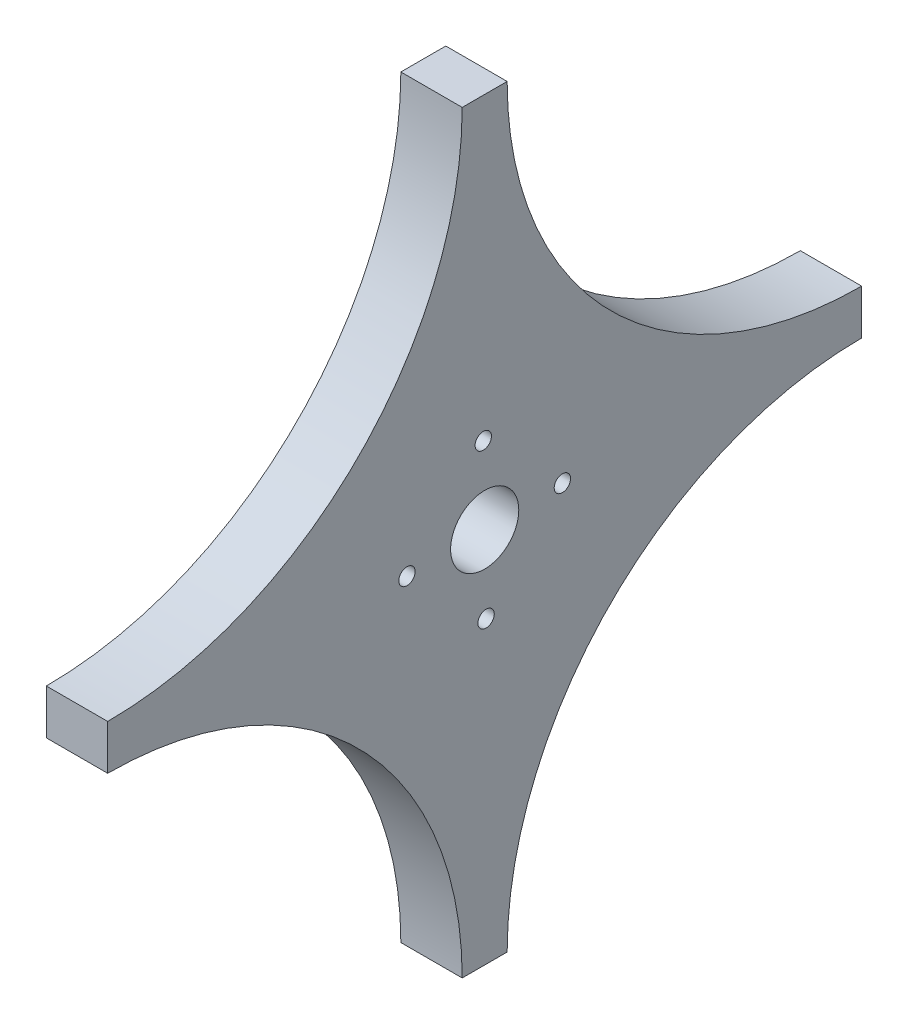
ISO-10303-21;
HEADER;
FILE_DESCRIPTION(('STEP AP214'),'2;1');
FILE_NAME('part.step','',(''),(''),'','','');
FILE_SCHEMA(('AUTOMOTIVE_DESIGN { 1 0 10303 214 1 1 1 1 }'));
ENDSEC;
DATA;
#1=APPLICATION_CONTEXT('core data for automotive mechanical design processes');
#2=APPLICATION_PROTOCOL_DEFINITION('international standard','automotive_design',2000,#1);
#3=PRODUCT_CONTEXT('',#1,'mechanical');
#4=PRODUCT('Part','Part','',(#3));
#5=PRODUCT_RELATED_PRODUCT_CATEGORY('part','',(#4));
#6=PRODUCT_DEFINITION_FORMATION('','',#4);
#7=PRODUCT_DEFINITION_CONTEXT('part definition',#1,'design');
#8=PRODUCT_DEFINITION('design','',#6,#7);
#9=PRODUCT_DEFINITION_SHAPE('','',#8);
#10=(LENGTH_UNIT() NAMED_UNIT(*) SI_UNIT(.MILLI.,.METRE.));
#11=(NAMED_UNIT(*) PLANE_ANGLE_UNIT() SI_UNIT($,.RADIAN.));
#12=(NAMED_UNIT(*) SI_UNIT($,.STERADIAN.) SOLID_ANGLE_UNIT());
#13=UNCERTAINTY_MEASURE_WITH_UNIT(LENGTH_MEASURE(1.E-05),#10,'distance_accuracy_value','');
#14=(GEOMETRIC_REPRESENTATION_CONTEXT(3) GLOBAL_UNCERTAINTY_ASSIGNED_CONTEXT((#13)) GLOBAL_UNIT_ASSIGNED_CONTEXT((#10,
#11,#12)) REPRESENTATION_CONTEXT('',''));
#15=CARTESIAN_POINT('',(0.,0.,0.));
#16=DIRECTION('',(0.,0.,1.));
#17=DIRECTION('',(1.,0.,0.));
#18=AXIS2_PLACEMENT_3D('',#15,#16,#17);
#19=CARTESIAN_POINT('',(5.715,35.1128014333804,-35.1128014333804));
#20=DIRECTION('',(1.,0.,0.));
#21=DIRECTION('',(0.,0.,-1.));
#22=AXIS2_PLACEMENT_3D('',#19,#20,#21);
#23=PLANE('',#22);
#24=CARTESIAN_POINT('',(5.715,-0.131551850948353,7.23780457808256));
#25=DIRECTION('',(-1.,0.,0.));
#26=DIRECTION('',(0.,0.,1.));
#27=AXIS2_PLACEMENT_3D('',#24,#25,#26);
#28=CIRCLE('',#27,0.761999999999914);
#29=CARTESIAN_POINT('',(5.715,-0.131551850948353,7.99980457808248));
#30=VERTEX_POINT('',#29);
#31=EDGE_CURVE('E207',#30,#30,#28,.T.);
#32=ORIENTED_EDGE('',*,*,#31,.T.);
#33=EDGE_LOOP('',(#32));
#34=FACE_BOUND('',#33,.T.);
#35=CARTESIAN_POINT('',(5.715,7.23780457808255,0.131551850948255));
#36=DIRECTION('',(-1.,0.,0.));
#37=DIRECTION('',(0.,0.,1.));
#38=AXIS2_PLACEMENT_3D('',#35,#36,#37);
#39=CIRCLE('',#38,0.761999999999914);
#40=CARTESIAN_POINT('',(5.715,7.23780457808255,0.893551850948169));
#41=VERTEX_POINT('',#40);
#42=EDGE_CURVE('E201',#41,#41,#39,.T.);
#43=ORIENTED_EDGE('',*,*,#42,.T.);
#44=EDGE_LOOP('',(#43));
#45=FACE_BOUND('',#44,.T.);
#46=CARTESIAN_POINT('',(5.715,0.131551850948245,-7.23780457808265));
#47=DIRECTION('',(-1.,0.,0.));
#48=DIRECTION('',(0.,0.,1.));
#49=AXIS2_PLACEMENT_3D('',#46,#47,#48);
#50=CIRCLE('',#49,0.761999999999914);
#51=CARTESIAN_POINT('',(5.715,0.131551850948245,-6.47580457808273));
#52=VERTEX_POINT('',#51);
#53=EDGE_CURVE('E195',#52,#52,#50,.T.);
#54=ORIENTED_EDGE('',*,*,#53,.T.);
#55=EDGE_LOOP('',(#54));
#56=FACE_BOUND('',#55,.T.);
#57=CARTESIAN_POINT('',(5.715,-7.23780457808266,-0.131551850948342));
#58=DIRECTION('',(-1.,0.,0.));
#59=DIRECTION('',(0.,0.,1.));
#60=AXIS2_PLACEMENT_3D('',#57,#58,#59);
#61=CIRCLE('',#60,0.761999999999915);
#62=CARTESIAN_POINT('',(5.715,-7.23780457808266,0.630448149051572));
#63=VERTEX_POINT('',#62);
#64=EDGE_CURVE('E189',#63,#63,#61,.T.);
#65=ORIENTED_EDGE('',*,*,#64,.T.);
#66=EDGE_LOOP('',(#65));
#67=FACE_BOUND('',#66,.T.);
#68=CARTESIAN_POINT('',(5.715,35.1128014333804,-35.1128014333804));
#69=DIRECTION('',(-1.,0.,0.));
#70=DIRECTION('',(0.,0.,-1.));
#71=AXIS2_PLACEMENT_3D('',#68,#69,#70);
#72=CIRCLE('',#71,33.02);
#73=CARTESIAN_POINT('',(5.715,2.09280143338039,-35.1128014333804));
#74=VERTEX_POINT('',#73);
#75=CARTESIAN_POINT('',(5.715,35.1128014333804,-2.09280143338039));
#76=VERTEX_POINT('',#75);
#77=EDGE_CURVE('E149',#74,#76,#72,.T.);
#78=ORIENTED_EDGE('',*,*,#77,.T.);
#79=DIRECTION('',(0.,0.,1.));
#80=VECTOR('',#79,1.);
#81=CARTESIAN_POINT('',(5.715,35.1128014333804,-2.09280143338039));
#82=LINE('',#81,#80);
#83=CARTESIAN_POINT('',(5.715,35.1128014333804,2.09280143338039));
#84=VERTEX_POINT('',#83);
#85=EDGE_CURVE('E97',#76,#84,#82,.T.);
#86=ORIENTED_EDGE('',*,*,#85,.T.);
#87=CARTESIAN_POINT('',(5.715,35.1128014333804,35.1128014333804));
#88=DIRECTION('',(-1.,0.,0.));
#89=DIRECTION('',(0.,0.,-1.));
#90=AXIS2_PLACEMENT_3D('',#87,#88,#89);
#91=CIRCLE('',#90,33.02);
#92=CARTESIAN_POINT('',(5.715,2.09280143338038,35.1128014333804));
#93=VERTEX_POINT('',#92);
#94=EDGE_CURVE('E164',#84,#93,#91,.T.);
#95=ORIENTED_EDGE('',*,*,#94,.T.);
#96=DIRECTION('',(0.,-1.,0.));
#97=VECTOR('',#96,1.);
#98=CARTESIAN_POINT('',(5.715,2.09280143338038,35.1128014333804));
#99=LINE('',#98,#97);
#100=CARTESIAN_POINT('',(5.715,-2.0928014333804,35.1128014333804));
#101=VERTEX_POINT('',#100);
#102=EDGE_CURVE('E177',#93,#101,#99,.T.);
#103=ORIENTED_EDGE('',*,*,#102,.T.);
#104=CARTESIAN_POINT('',(5.715,-35.1128014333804,35.1128014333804));
#105=DIRECTION('',(-1.,0.,0.));
#106=DIRECTION('',(0.,0.,-1.));
#107=AXIS2_PLACEMENT_3D('',#104,#105,#106);
#108=CIRCLE('',#107,33.02);
#109=CARTESIAN_POINT('',(5.715,-35.1128014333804,2.09280143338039));
#110=VERTEX_POINT('',#109);
#111=EDGE_CURVE('E116',#101,#110,#108,.T.);
#112=ORIENTED_EDGE('',*,*,#111,.T.);
#113=DIRECTION('',(0.,0.,-1.));
#114=VECTOR('',#113,1.);
#115=CARTESIAN_POINT('',(5.715,-35.1128014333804,2.09280143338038));
#116=LINE('',#115,#114);
#117=CARTESIAN_POINT('',(5.715,-35.1128014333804,-2.09280143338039));
#118=VERTEX_POINT('',#117);
#119=EDGE_CURVE('E110',#110,#118,#116,.T.);
#120=ORIENTED_EDGE('',*,*,#119,.T.);
#121=CARTESIAN_POINT('',(5.715,-35.1128014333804,-35.1128014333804));
#122=DIRECTION('',(-1.,0.,0.));
#123=DIRECTION('',(0.,0.,-1.));
#124=AXIS2_PLACEMENT_3D('',#121,#122,#123);
#125=CIRCLE('',#124,33.02);
#126=CARTESIAN_POINT('',(5.715,-2.09280143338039,-35.1128014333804));
#127=VERTEX_POINT('',#126);
#128=EDGE_CURVE('E114',#118,#127,#125,.T.);
#129=ORIENTED_EDGE('',*,*,#128,.T.);
#130=DIRECTION('',(0.,1.,0.));
#131=VECTOR('',#130,1.);
#132=CARTESIAN_POINT('',(5.715,2.09280143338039,-35.1128014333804));
#133=LINE('',#132,#131);
#134=EDGE_CURVE('E54',#127,#74,#133,.T.);
#135=ORIENTED_EDGE('',*,*,#134,.T.);
#136=EDGE_LOOP('',(#78,#86,#95,#103,#112,#120,#129,#135));
#137=FACE_BOUND('',#136,.T.);
#138=CARTESIAN_POINT('',(5.715,0.,0.));
#139=DIRECTION('',(1.,0.,0.));
#140=DIRECTION('',(0.,0.,-1.));
#141=AXIS2_PLACEMENT_3D('',#138,#139,#140);
#142=CIRCLE('',#141,3.175);
#143=CARTESIAN_POINT('',(5.715,0.,-3.175));
#144=VERTEX_POINT('',#143);
#145=EDGE_CURVE('E138',#144,#144,#142,.T.);
#146=ORIENTED_EDGE('',*,*,#145,.F.);
#147=EDGE_LOOP('',(#146));
#148=FACE_BOUND('',#147,.T.);
#149=ADVANCED_FACE('F37',(#34,#45,#56,#67,#137,#148),#23,.T.);
#150=CARTESIAN_POINT('',(0.,35.1128014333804,-35.1128014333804));
#151=DIRECTION('',(1.,0.,0.));
#152=DIRECTION('',(0.,0.,-1.));
#153=AXIS2_PLACEMENT_3D('',#150,#151,#152);
#154=PLANE('',#153);
#155=CARTESIAN_POINT('',(0.,-0.131551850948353,7.23780457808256));
#156=DIRECTION('',(-1.,0.,0.));
#157=DIRECTION('',(0.,0.,1.));
#158=AXIS2_PLACEMENT_3D('',#155,#156,#157);
#159=CIRCLE('',#158,0.761999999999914);
#160=CARTESIAN_POINT('',(0.,-0.131551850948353,7.99980457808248));
#161=VERTEX_POINT('',#160);
#162=EDGE_CURVE('E186',#161,#161,#159,.T.);
#163=ORIENTED_EDGE('',*,*,#162,.F.);
#164=EDGE_LOOP('',(#163));
#165=FACE_BOUND('',#164,.T.);
#166=CARTESIAN_POINT('',(0.,7.23780457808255,0.131551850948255));
#167=DIRECTION('',(-1.,0.,0.));
#168=DIRECTION('',(0.,0.,1.));
#169=AXIS2_PLACEMENT_3D('',#166,#167,#168);
#170=CIRCLE('',#169,0.761999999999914);
#171=CARTESIAN_POINT('',(0.,7.23780457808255,0.893551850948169));
#172=VERTEX_POINT('',#171);
#173=EDGE_CURVE('E204',#172,#172,#170,.T.);
#174=ORIENTED_EDGE('',*,*,#173,.F.);
#175=EDGE_LOOP('',(#174));
#176=FACE_BOUND('',#175,.T.);
#177=CARTESIAN_POINT('',(0.,0.131551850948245,-7.23780457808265));
#178=DIRECTION('',(-1.,0.,0.));
#179=DIRECTION('',(0.,0.,1.));
#180=AXIS2_PLACEMENT_3D('',#177,#178,#179);
#181=CIRCLE('',#180,0.761999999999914);
#182=CARTESIAN_POINT('',(0.,0.131551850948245,-6.47580457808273));
#183=VERTEX_POINT('',#182);
#184=EDGE_CURVE('E198',#183,#183,#181,.T.);
#185=ORIENTED_EDGE('',*,*,#184,.F.);
#186=EDGE_LOOP('',(#185));
#187=FACE_BOUND('',#186,.T.);
#188=CARTESIAN_POINT('',(0.,-7.23780457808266,-0.131551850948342));
#189=DIRECTION('',(-1.,0.,0.));
#190=DIRECTION('',(0.,0.,1.));
#191=AXIS2_PLACEMENT_3D('',#188,#189,#190);
#192=CIRCLE('',#191,0.761999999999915);
#193=CARTESIAN_POINT('',(0.,-7.23780457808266,0.630448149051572));
#194=VERTEX_POINT('',#193);
#195=EDGE_CURVE('E192',#194,#194,#192,.T.);
#196=ORIENTED_EDGE('',*,*,#195,.F.);
#197=EDGE_LOOP('',(#196));
#198=FACE_BOUND('',#197,.T.);
#199=CARTESIAN_POINT('',(0.,35.1128014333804,-35.1128014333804));
#200=DIRECTION('',(-1.,0.,0.));
#201=DIRECTION('',(0.,0.,-1.));
#202=AXIS2_PLACEMENT_3D('',#199,#200,#201);
#203=CIRCLE('',#202,33.02);
#204=CARTESIAN_POINT('',(0.,2.09280143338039,-35.1128014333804));
#205=VERTEX_POINT('',#204);
#206=CARTESIAN_POINT('',(0.,35.1128014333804,-2.09280143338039));
#207=VERTEX_POINT('',#206);
#208=EDGE_CURVE('E134',#205,#207,#203,.T.);
#209=ORIENTED_EDGE('',*,*,#208,.F.);
#210=DIRECTION('',(0.,1.,0.));
#211=VECTOR('',#210,1.);
#212=CARTESIAN_POINT('',(0.,2.09280143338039,-35.1128014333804));
#213=LINE('',#212,#211);
#214=CARTESIAN_POINT('',(0.,-2.09280143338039,-35.1128014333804));
#215=VERTEX_POINT('',#214);
#216=EDGE_CURVE('E89',#215,#205,#213,.T.);
#217=ORIENTED_EDGE('',*,*,#216,.F.);
#218=CARTESIAN_POINT('',(0.,-35.1128014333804,-35.1128014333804));
#219=DIRECTION('',(-1.,0.,0.));
#220=DIRECTION('',(0.,0.,-1.));
#221=AXIS2_PLACEMENT_3D('',#218,#219,#220);
#222=CIRCLE('',#221,33.02);
#223=CARTESIAN_POINT('',(0.,-35.1128014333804,-2.09280143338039));
#224=VERTEX_POINT('',#223);
#225=EDGE_CURVE('E83',#224,#215,#222,.T.);
#226=ORIENTED_EDGE('',*,*,#225,.F.);
#227=DIRECTION('',(0.,0.,-1.));
#228=VECTOR('',#227,1.);
#229=CARTESIAN_POINT('',(0.,-35.1128014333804,2.09280143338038));
#230=LINE('',#229,#228);
#231=CARTESIAN_POINT('',(0.,-35.1128014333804,2.09280143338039));
#232=VERTEX_POINT('',#231);
#233=EDGE_CURVE('E124',#232,#224,#230,.T.);
#234=ORIENTED_EDGE('',*,*,#233,.F.);
#235=CARTESIAN_POINT('',(0.,-35.1128014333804,35.1128014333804));
#236=DIRECTION('',(-1.,0.,0.));
#237=DIRECTION('',(0.,0.,-1.));
#238=AXIS2_PLACEMENT_3D('',#235,#236,#237);
#239=CIRCLE('',#238,33.02);
#240=CARTESIAN_POINT('',(0.,-2.0928014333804,35.1128014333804));
#241=VERTEX_POINT('',#240);
#242=EDGE_CURVE('E144',#241,#232,#239,.T.);
#243=ORIENTED_EDGE('',*,*,#242,.F.);
#244=DIRECTION('',(0.,-1.,0.));
#245=VECTOR('',#244,1.);
#246=CARTESIAN_POINT('',(0.,2.09280143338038,35.1128014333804));
#247=LINE('',#246,#245);
#248=CARTESIAN_POINT('',(0.,2.09280143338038,35.1128014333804));
#249=VERTEX_POINT('',#248);
#250=EDGE_CURVE('E142',#249,#241,#247,.T.);
#251=ORIENTED_EDGE('',*,*,#250,.F.);
#252=CARTESIAN_POINT('',(0.,35.1128014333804,35.1128014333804));
#253=DIRECTION('',(-1.,0.,0.));
#254=DIRECTION('',(0.,0.,-1.));
#255=AXIS2_PLACEMENT_3D('',#252,#253,#254);
#256=CIRCLE('',#255,33.02);
#257=CARTESIAN_POINT('',(0.,35.1128014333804,2.09280143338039));
#258=VERTEX_POINT('',#257);
#259=EDGE_CURVE('E140',#258,#249,#256,.T.);
#260=ORIENTED_EDGE('',*,*,#259,.F.);
#261=DIRECTION('',(0.,0.,1.));
#262=VECTOR('',#261,1.);
#263=CARTESIAN_POINT('',(0.,35.1128014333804,-2.09280143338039));
#264=LINE('',#263,#262);
#265=EDGE_CURVE('E137',#207,#258,#264,.T.);
#266=ORIENTED_EDGE('',*,*,#265,.F.);
#267=EDGE_LOOP('',(#209,#217,#226,#234,#243,#251,#260,#266));
#268=FACE_BOUND('',#267,.T.);
#269=CARTESIAN_POINT('',(0.,0.,0.));
#270=DIRECTION('',(1.,0.,0.));
#271=DIRECTION('',(0.,0.,-1.));
#272=AXIS2_PLACEMENT_3D('',#269,#270,#271);
#273=CIRCLE('',#272,3.175);
#274=CARTESIAN_POINT('',(0.,0.,-3.175));
#275=VERTEX_POINT('',#274);
#276=EDGE_CURVE('E183',#275,#275,#273,.T.);
#277=ORIENTED_EDGE('',*,*,#276,.T.);
#278=EDGE_LOOP('',(#277));
#279=FACE_BOUND('',#278,.T.);
#280=ADVANCED_FACE('F168',(#165,#176,#187,#198,#268,#279),#154,.F.);
#281=CARTESIAN_POINT('',(5.715,35.1128014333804,-35.1128014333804));
#282=DIRECTION('',(-1.,0.,0.));
#283=DIRECTION('',(0.,0.,1.));
#284=AXIS2_PLACEMENT_3D('',#281,#282,#283);
#285=CYLINDRICAL_SURFACE('',#284,33.02);
#286=ORIENTED_EDGE('',*,*,#208,.T.);
#287=DIRECTION('',(-1.,0.,0.));
#288=VECTOR('',#287,1.);
#289=CARTESIAN_POINT('',(5.715,35.1128014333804,-2.09280143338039));
#290=LINE('',#289,#288);
#291=EDGE_CURVE('E11',#76,#207,#290,.T.);
#292=ORIENTED_EDGE('',*,*,#291,.F.);
#293=ORIENTED_EDGE('',*,*,#77,.F.);
#294=DIRECTION('',(-1.,0.,0.));
#295=VECTOR('',#294,1.);
#296=CARTESIAN_POINT('',(5.715,2.09280143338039,-35.1128014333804));
#297=LINE('',#296,#295);
#298=EDGE_CURVE('E130',#74,#205,#297,.T.);
#299=ORIENTED_EDGE('',*,*,#298,.T.);
#300=EDGE_LOOP('',(#286,#292,#293,#299));
#301=FACE_BOUND('',#300,.T.);
#302=ADVANCED_FACE('F39',(#301),#285,.F.);
#303=CARTESIAN_POINT('',(5.715,35.1128014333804,-2.09280143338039));
#304=DIRECTION('',(0.,-1.,0.));
#305=DIRECTION('',(0.,0.,-1.));
#306=AXIS2_PLACEMENT_3D('',#303,#304,#305);
#307=PLANE('',#306);
#308=ORIENTED_EDGE('',*,*,#265,.T.);
#309=DIRECTION('',(-1.,0.,0.));
#310=VECTOR('',#309,1.);
#311=CARTESIAN_POINT('',(5.715,35.1128014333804,2.09280143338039));
#312=LINE('',#311,#310);
#313=EDGE_CURVE('E46',#84,#258,#312,.T.);
#314=ORIENTED_EDGE('',*,*,#313,.F.);
#315=ORIENTED_EDGE('',*,*,#85,.F.);
#316=ORIENTED_EDGE('',*,*,#291,.T.);
#317=EDGE_LOOP('',(#308,#314,#315,#316));
#318=FACE_BOUND('',#317,.T.);
#319=ADVANCED_FACE('F253',(#318),#307,.F.);
#320=CARTESIAN_POINT('',(5.715,35.1128014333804,35.1128014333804));
#321=DIRECTION('',(-1.,0.,0.));
#322=DIRECTION('',(0.,0.,1.));
#323=AXIS2_PLACEMENT_3D('',#320,#321,#322);
#324=CYLINDRICAL_SURFACE('',#323,33.02);
#325=ORIENTED_EDGE('',*,*,#259,.T.);
#326=DIRECTION('',(-1.,0.,0.));
#327=VECTOR('',#326,1.);
#328=CARTESIAN_POINT('',(5.715,2.09280143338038,35.1128014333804));
#329=LINE('',#328,#327);
#330=EDGE_CURVE('E156',#93,#249,#329,.T.);
#331=ORIENTED_EDGE('',*,*,#330,.F.);
#332=ORIENTED_EDGE('',*,*,#94,.F.);
#333=ORIENTED_EDGE('',*,*,#313,.T.);
#334=EDGE_LOOP('',(#325,#331,#332,#333));
#335=FACE_BOUND('',#334,.T.);
#336=ADVANCED_FACE('F162',(#335),#324,.F.);
#337=CARTESIAN_POINT('',(5.715,2.09280143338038,35.1128014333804));
#338=DIRECTION('',(0.,0.,-1.));
#339=DIRECTION('',(0.,1.,0.));
#340=AXIS2_PLACEMENT_3D('',#337,#338,#339);
#341=PLANE('',#340);
#342=ORIENTED_EDGE('',*,*,#250,.T.);
#343=DIRECTION('',(-1.,0.,0.));
#344=VECTOR('',#343,1.);
#345=CARTESIAN_POINT('',(5.715,-2.0928014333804,35.1128014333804));
#346=LINE('',#345,#344);
#347=EDGE_CURVE('E153',#101,#241,#346,.T.);
#348=ORIENTED_EDGE('',*,*,#347,.F.);
#349=ORIENTED_EDGE('',*,*,#102,.F.);
#350=ORIENTED_EDGE('',*,*,#330,.T.);
#351=EDGE_LOOP('',(#342,#348,#349,#350));
#352=FACE_BOUND('',#351,.T.);
#353=ADVANCED_FACE('F173',(#352),#341,.F.);
#354=CARTESIAN_POINT('',(5.715,-35.1128014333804,35.1128014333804));
#355=DIRECTION('',(-1.,0.,0.));
#356=DIRECTION('',(0.,0.,1.));
#357=AXIS2_PLACEMENT_3D('',#354,#355,#356);
#358=CYLINDRICAL_SURFACE('',#357,33.02);
#359=ORIENTED_EDGE('',*,*,#242,.T.);
#360=DIRECTION('',(-1.,0.,0.));
#361=VECTOR('',#360,1.);
#362=CARTESIAN_POINT('',(5.715,-35.1128014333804,2.09280143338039));
#363=LINE('',#362,#361);
#364=EDGE_CURVE('E125',#110,#232,#363,.T.);
#365=ORIENTED_EDGE('',*,*,#364,.F.);
#366=ORIENTED_EDGE('',*,*,#111,.F.);
#367=ORIENTED_EDGE('',*,*,#347,.T.);
#368=EDGE_LOOP('',(#359,#365,#366,#367));
#369=FACE_BOUND('',#368,.T.);
#370=ADVANCED_FACE('F176',(#369),#358,.F.);
#371=CARTESIAN_POINT('',(5.715,-35.1128014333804,2.09280143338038));
#372=DIRECTION('',(0.,1.,0.));
#373=DIRECTION('',(0.,0.,1.));
#374=AXIS2_PLACEMENT_3D('',#371,#372,#373);
#375=PLANE('',#374);
#376=ORIENTED_EDGE('',*,*,#233,.T.);
#377=DIRECTION('',(-1.,0.,0.));
#378=VECTOR('',#377,1.);
#379=CARTESIAN_POINT('',(5.715,-35.1128014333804,-2.09280143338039));
#380=LINE('',#379,#378);
#381=EDGE_CURVE('E121',#118,#224,#380,.T.);
#382=ORIENTED_EDGE('',*,*,#381,.F.);
#383=ORIENTED_EDGE('',*,*,#119,.F.);
#384=ORIENTED_EDGE('',*,*,#364,.T.);
#385=EDGE_LOOP('',(#376,#382,#383,#384));
#386=FACE_BOUND('',#385,.T.);
#387=ADVANCED_FACE('F122',(#386),#375,.F.);
#388=CARTESIAN_POINT('',(5.715,-35.1128014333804,-35.1128014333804));
#389=DIRECTION('',(-1.,0.,0.));
#390=DIRECTION('',(0.,0.,1.));
#391=AXIS2_PLACEMENT_3D('',#388,#389,#390);
#392=CYLINDRICAL_SURFACE('',#391,33.02);
#393=ORIENTED_EDGE('',*,*,#225,.T.);
#394=DIRECTION('',(-1.,0.,0.));
#395=VECTOR('',#394,1.);
#396=CARTESIAN_POINT('',(5.715,-2.09280143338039,-35.1128014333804));
#397=LINE('',#396,#395);
#398=EDGE_CURVE('E126',#127,#215,#397,.T.);
#399=ORIENTED_EDGE('',*,*,#398,.F.);
#400=ORIENTED_EDGE('',*,*,#128,.F.);
#401=ORIENTED_EDGE('',*,*,#381,.T.);
#402=EDGE_LOOP('',(#393,#399,#400,#401));
#403=FACE_BOUND('',#402,.T.);
#404=ADVANCED_FACE('F128',(#403),#392,.F.);
#405=CARTESIAN_POINT('',(5.715,2.09280143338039,-35.1128014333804));
#406=DIRECTION('',(0.,0.,1.));
#407=DIRECTION('',(0.,-1.,0.));
#408=AXIS2_PLACEMENT_3D('',#405,#406,#407);
#409=PLANE('',#408);
#410=ORIENTED_EDGE('',*,*,#216,.T.);
#411=ORIENTED_EDGE('',*,*,#298,.F.);
#412=ORIENTED_EDGE('',*,*,#134,.F.);
#413=ORIENTED_EDGE('',*,*,#398,.T.);
#414=EDGE_LOOP('',(#410,#411,#412,#413));
#415=FACE_BOUND('',#414,.T.);
#416=ADVANCED_FACE('F241',(#415),#409,.F.);
#417=CARTESIAN_POINT('',(5.715,0.,0.));
#418=DIRECTION('',(-1.,0.,0.));
#419=DIRECTION('',(0.,0.,1.));
#420=AXIS2_PLACEMENT_3D('',#417,#418,#419);
#421=CYLINDRICAL_SURFACE('',#420,3.175);
#422=ORIENTED_EDGE('',*,*,#145,.T.);
#423=EDGE_LOOP('',(#422));
#424=FACE_BOUND('',#423,.T.);
#425=ORIENTED_EDGE('',*,*,#276,.F.);
#426=EDGE_LOOP('',(#425));
#427=FACE_BOUND('',#426,.T.);
#428=ADVANCED_FACE('F229',(#424,#427),#421,.F.);
#429=CARTESIAN_POINT('',(0.,-7.23780457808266,-0.131551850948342));
#430=DIRECTION('',(1.,0.,0.));
#431=DIRECTION('',(0.,0.,-1.));
#432=AXIS2_PLACEMENT_3D('',#429,#430,#431);
#433=CYLINDRICAL_SURFACE('',#432,0.761999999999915);
#434=ORIENTED_EDGE('',*,*,#195,.T.);
#435=EDGE_LOOP('',(#434));
#436=FACE_BOUND('',#435,.T.);
#437=ORIENTED_EDGE('',*,*,#64,.F.);
#438=EDGE_LOOP('',(#437));
#439=FACE_BOUND('',#438,.T.);
#440=ADVANCED_FACE('F225',(#436,#439),#433,.F.);
#441=CARTESIAN_POINT('',(0.,0.131551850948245,-7.23780457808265));
#442=DIRECTION('',(1.,0.,0.));
#443=DIRECTION('',(0.,0.,-1.));
#444=AXIS2_PLACEMENT_3D('',#441,#442,#443);
#445=CYLINDRICAL_SURFACE('',#444,0.761999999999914);
#446=ORIENTED_EDGE('',*,*,#184,.T.);
#447=EDGE_LOOP('',(#446));
#448=FACE_BOUND('',#447,.T.);
#449=ORIENTED_EDGE('',*,*,#53,.F.);
#450=EDGE_LOOP('',(#449));
#451=FACE_BOUND('',#450,.T.);
#452=ADVANCED_FACE('F228',(#448,#451),#445,.F.);
#453=CARTESIAN_POINT('',(0.,7.23780457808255,0.131551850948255));
#454=DIRECTION('',(1.,0.,0.));
#455=DIRECTION('',(0.,0.,-1.));
#456=AXIS2_PLACEMENT_3D('',#453,#454,#455);
#457=CYLINDRICAL_SURFACE('',#456,0.761999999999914);
#458=ORIENTED_EDGE('',*,*,#173,.T.);
#459=EDGE_LOOP('',(#458));
#460=FACE_BOUND('',#459,.T.);
#461=ORIENTED_EDGE('',*,*,#42,.F.);
#462=EDGE_LOOP('',(#461));
#463=FACE_BOUND('',#462,.T.);
#464=ADVANCED_FACE('F287',(#460,#463),#457,.F.);
#465=CARTESIAN_POINT('',(0.,-0.131551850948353,7.23780457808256));
#466=DIRECTION('',(1.,0.,0.));
#467=DIRECTION('',(0.,0.,-1.));
#468=AXIS2_PLACEMENT_3D('',#465,#466,#467);
#469=CYLINDRICAL_SURFACE('',#468,0.761999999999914);
#470=ORIENTED_EDGE('',*,*,#162,.T.);
#471=EDGE_LOOP('',(#470));
#472=FACE_BOUND('',#471,.T.);
#473=ORIENTED_EDGE('',*,*,#31,.F.);
#474=EDGE_LOOP('',(#473));
#475=FACE_BOUND('',#474,.T.);
#476=ADVANCED_FACE('F213',(#472,#475),#469,.F.);
#477=CLOSED_SHELL('',(#149,#280,#302,#319,#336,#353,#370,#387,#404,#416,#428,#440,#452,#464,#476));
#478=MANIFOLD_SOLID_BREP('B2',#477);
#479=ADVANCED_BREP_SHAPE_REPRESENTATION('',(#18,#478),#14);
#480=SHAPE_DEFINITION_REPRESENTATION(#9,#479);
ENDSEC;
END-ISO-10303-21;
